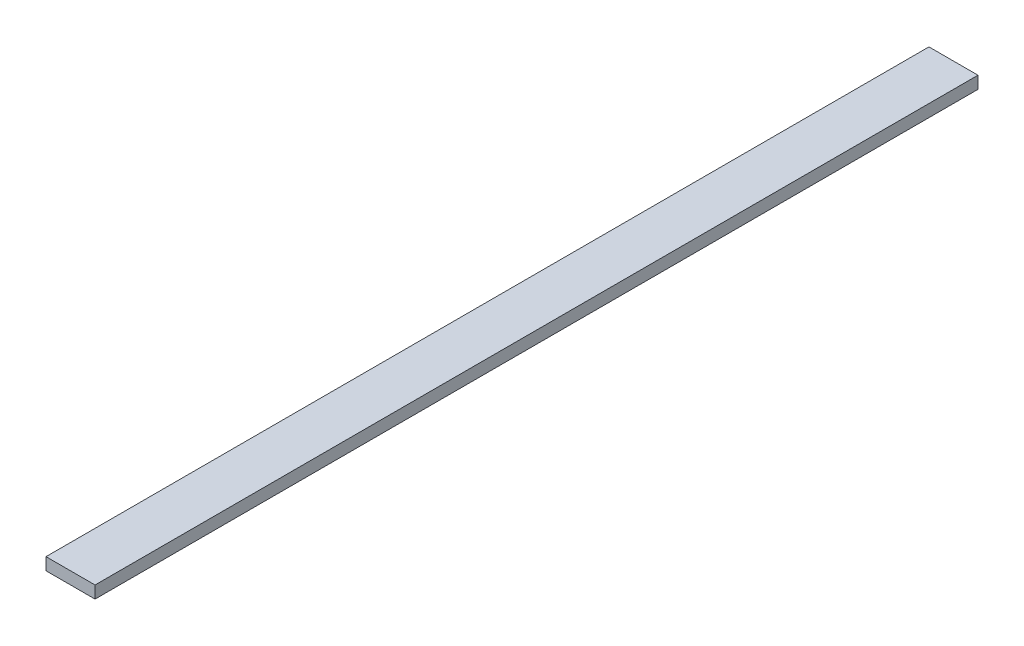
ISO-10303-21;
HEADER;
FILE_DESCRIPTION(('STEP AP214'),'2;1');
FILE_NAME('part.step','',(''),(''),'','','');
FILE_SCHEMA(('AUTOMOTIVE_DESIGN { 1 0 10303 214 1 1 1 1 }'));
ENDSEC;
DATA;
#1=APPLICATION_CONTEXT('core data for automotive mechanical design processes');
#2=APPLICATION_PROTOCOL_DEFINITION('international standard','automotive_design',2000,#1);
#3=PRODUCT_CONTEXT('',#1,'mechanical');
#4=PRODUCT('Part','Part','',(#3));
#5=PRODUCT_RELATED_PRODUCT_CATEGORY('part','',(#4));
#6=PRODUCT_DEFINITION_FORMATION('','',#4);
#7=PRODUCT_DEFINITION_CONTEXT('part definition',#1,'design');
#8=PRODUCT_DEFINITION('design','',#6,#7);
#9=PRODUCT_DEFINITION_SHAPE('','',#8);
#10=(LENGTH_UNIT() NAMED_UNIT(*) SI_UNIT(.MILLI.,.METRE.));
#11=(NAMED_UNIT(*) PLANE_ANGLE_UNIT() SI_UNIT($,.RADIAN.));
#12=(NAMED_UNIT(*) SI_UNIT($,.STERADIAN.) SOLID_ANGLE_UNIT());
#13=UNCERTAINTY_MEASURE_WITH_UNIT(LENGTH_MEASURE(1.E-05),#10,'distance_accuracy_value','');
#14=(GEOMETRIC_REPRESENTATION_CONTEXT(3) GLOBAL_UNCERTAINTY_ASSIGNED_CONTEXT((#13)) GLOBAL_UNIT_ASSIGNED_CONTEXT((#10,
#11,#12)) REPRESENTATION_CONTEXT('',''));
#15=CARTESIAN_POINT('',(0.,0.,0.));
#16=DIRECTION('',(0.,0.,1.));
#17=DIRECTION('',(1.,0.,0.));
#18=AXIS2_PLACEMENT_3D('',#15,#16,#17);
#19=CARTESIAN_POINT('',(25.4,-6.35,914.4));
#20=DIRECTION('',(-1.,0.,0.));
#21=DIRECTION('',(0.,0.,1.));
#22=AXIS2_PLACEMENT_3D('',#19,#20,#21);
#23=PLANE('',#22);
#24=DIRECTION('',(0.,1.,0.));
#25=VECTOR('',#24,1.);
#26=CARTESIAN_POINT('',(25.4,-6.35,0.));
#27=LINE('',#26,#25);
#28=CARTESIAN_POINT('',(25.4,-6.35,0.));
#29=VERTEX_POINT('',#28);
#30=CARTESIAN_POINT('',(25.4,6.35,0.));
#31=VERTEX_POINT('',#30);
#32=EDGE_CURVE('E113',#29,#31,#27,.T.);
#33=ORIENTED_EDGE('',*,*,#32,.T.);
#34=DIRECTION('',(0.,0.,-1.));
#35=VECTOR('',#34,1.);
#36=CARTESIAN_POINT('',(25.4,6.35,914.4));
#37=LINE('',#36,#35);
#38=CARTESIAN_POINT('',(25.4,6.35,914.4));
#39=VERTEX_POINT('',#38);
#40=EDGE_CURVE('E11',#39,#31,#37,.T.);
#41=ORIENTED_EDGE('',*,*,#40,.F.);
#42=DIRECTION('',(0.,1.,0.));
#43=VECTOR('',#42,1.);
#44=CARTESIAN_POINT('',(25.4,-6.35,914.4));
#45=LINE('',#44,#43);
#46=CARTESIAN_POINT('',(25.4,-6.35,914.4));
#47=VERTEX_POINT('',#46);
#48=EDGE_CURVE('E97',#47,#39,#45,.T.);
#49=ORIENTED_EDGE('',*,*,#48,.F.);
#50=DIRECTION('',(0.,0.,-1.));
#51=VECTOR('',#50,1.);
#52=CARTESIAN_POINT('',(25.4,-6.35,914.4));
#53=LINE('',#52,#51);
#54=EDGE_CURVE('E109',#47,#29,#53,.T.);
#55=ORIENTED_EDGE('',*,*,#54,.T.);
#56=EDGE_LOOP('',(#33,#41,#49,#55));
#57=FACE_BOUND('',#56,.T.);
#58=ADVANCED_FACE('F45',(#57),#23,.F.);
#59=CARTESIAN_POINT('',(-25.4,6.35,914.4));
#60=DIRECTION('',(0.,-1.,0.));
#61=DIRECTION('',(0.,0.,-1.));
#62=AXIS2_PLACEMENT_3D('',#59,#60,#61);
#63=PLANE('',#62);
#64=DIRECTION('',(-1.,0.,0.));
#65=VECTOR('',#64,1.);
#66=CARTESIAN_POINT('',(-25.4,6.35,0.));
#67=LINE('',#66,#65);
#68=CARTESIAN_POINT('',(-25.4,6.35,0.));
#69=VERTEX_POINT('',#68);
#70=EDGE_CURVE('E102',#31,#69,#67,.T.);
#71=ORIENTED_EDGE('',*,*,#70,.T.);
#72=DIRECTION('',(0.,0.,-1.));
#73=VECTOR('',#72,1.);
#74=CARTESIAN_POINT('',(-25.4,6.35,914.4));
#75=LINE('',#74,#73);
#76=CARTESIAN_POINT('',(-25.4,6.35,914.4));
#77=VERTEX_POINT('',#76);
#78=EDGE_CURVE('E54',#77,#69,#75,.T.);
#79=ORIENTED_EDGE('',*,*,#78,.F.);
#80=DIRECTION('',(-1.,0.,0.));
#81=VECTOR('',#80,1.);
#82=CARTESIAN_POINT('',(-25.4,6.35,914.4));
#83=LINE('',#82,#81);
#84=EDGE_CURVE('E92',#39,#77,#83,.T.);
#85=ORIENTED_EDGE('',*,*,#84,.F.);
#86=ORIENTED_EDGE('',*,*,#40,.T.);
#87=EDGE_LOOP('',(#71,#79,#85,#86));
#88=FACE_BOUND('',#87,.T.);
#89=ADVANCED_FACE('F101',(#88),#63,.F.);
#90=CARTESIAN_POINT('',(-25.4,-6.35,914.4));
#91=DIRECTION('',(1.,0.,0.));
#92=DIRECTION('',(0.,0.,-1.));
#93=AXIS2_PLACEMENT_3D('',#90,#91,#92);
#94=PLANE('',#93);
#95=DIRECTION('',(0.,-1.,0.));
#96=VECTOR('',#95,1.);
#97=CARTESIAN_POINT('',(-25.4,-6.35,0.));
#98=LINE('',#97,#96);
#99=CARTESIAN_POINT('',(-25.4,-6.35,0.));
#100=VERTEX_POINT('',#99);
#101=EDGE_CURVE('E79',#69,#100,#98,.T.);
#102=ORIENTED_EDGE('',*,*,#101,.T.);
#103=DIRECTION('',(0.,0.,-1.));
#104=VECTOR('',#103,1.);
#105=CARTESIAN_POINT('',(-25.4,-6.35,914.4));
#106=LINE('',#105,#104);
#107=CARTESIAN_POINT('',(-25.4,-6.35,914.4));
#108=VERTEX_POINT('',#107);
#109=EDGE_CURVE('E104',#108,#100,#106,.T.);
#110=ORIENTED_EDGE('',*,*,#109,.F.);
#111=DIRECTION('',(0.,-1.,0.));
#112=VECTOR('',#111,1.);
#113=CARTESIAN_POINT('',(-25.4,-6.35,914.4));
#114=LINE('',#113,#112);
#115=EDGE_CURVE('E95',#77,#108,#114,.T.);
#116=ORIENTED_EDGE('',*,*,#115,.F.);
#117=ORIENTED_EDGE('',*,*,#78,.T.);
#118=EDGE_LOOP('',(#102,#110,#116,#117));
#119=FACE_BOUND('',#118,.T.);
#120=ADVANCED_FACE('F105',(#119),#94,.F.);
#121=CARTESIAN_POINT('',(-25.4,-6.35,914.4));
#122=DIRECTION('',(0.,1.,0.));
#123=DIRECTION('',(0.,0.,1.));
#124=AXIS2_PLACEMENT_3D('',#121,#122,#123);
#125=PLANE('',#124);
#126=DIRECTION('',(1.,0.,0.));
#127=VECTOR('',#126,1.);
#128=CARTESIAN_POINT('',(-25.4,-6.35,0.));
#129=LINE('',#128,#127);
#130=EDGE_CURVE('E85',#100,#29,#129,.T.);
#131=ORIENTED_EDGE('',*,*,#130,.T.);
#132=ORIENTED_EDGE('',*,*,#54,.F.);
#133=DIRECTION('',(1.,0.,0.));
#134=VECTOR('',#133,1.);
#135=CARTESIAN_POINT('',(-25.4,-6.35,914.4));
#136=LINE('',#135,#134);
#137=EDGE_CURVE('E62',#108,#47,#136,.T.);
#138=ORIENTED_EDGE('',*,*,#137,.F.);
#139=ORIENTED_EDGE('',*,*,#109,.T.);
#140=EDGE_LOOP('',(#131,#132,#138,#139));
#141=FACE_BOUND('',#140,.T.);
#142=ADVANCED_FACE('F126',(#141),#125,.F.);
#143=CARTESIAN_POINT('',(0.,0.,914.4));
#144=DIRECTION('',(0.,0.,-1.));
#145=DIRECTION('',(-1.,0.,0.));
#146=AXIS2_PLACEMENT_3D('',#143,#144,#145);
#147=PLANE('',#146);
#148=ORIENTED_EDGE('',*,*,#48,.T.);
#149=ORIENTED_EDGE('',*,*,#84,.T.);
#150=ORIENTED_EDGE('',*,*,#115,.T.);
#151=ORIENTED_EDGE('',*,*,#137,.T.);
#152=EDGE_LOOP('',(#148,#149,#150,#151));
#153=FACE_BOUND('',#152,.T.);
#154=ADVANCED_FACE('F93',(#153),#147,.F.);
#155=CARTESIAN_POINT('',(0.,0.,0.));
#156=DIRECTION('',(0.,0.,-1.));
#157=DIRECTION('',(-1.,0.,0.));
#158=AXIS2_PLACEMENT_3D('',#155,#156,#157);
#159=PLANE('',#158);
#160=ORIENTED_EDGE('',*,*,#32,.F.);
#161=ORIENTED_EDGE('',*,*,#130,.F.);
#162=ORIENTED_EDGE('',*,*,#101,.F.);
#163=ORIENTED_EDGE('',*,*,#70,.F.);
#164=EDGE_LOOP('',(#160,#161,#162,#163));
#165=FACE_BOUND('',#164,.T.);
#166=ADVANCED_FACE('F129',(#165),#159,.T.);
#167=CLOSED_SHELL('',(#58,#89,#120,#142,#154,#166));
#168=MANIFOLD_SOLID_BREP('B2',#167);
#169=ADVANCED_BREP_SHAPE_REPRESENTATION('',(#18,#168),#14);
#170=SHAPE_DEFINITION_REPRESENTATION(#9,#169);
ENDSEC;
END-ISO-10303-21;
